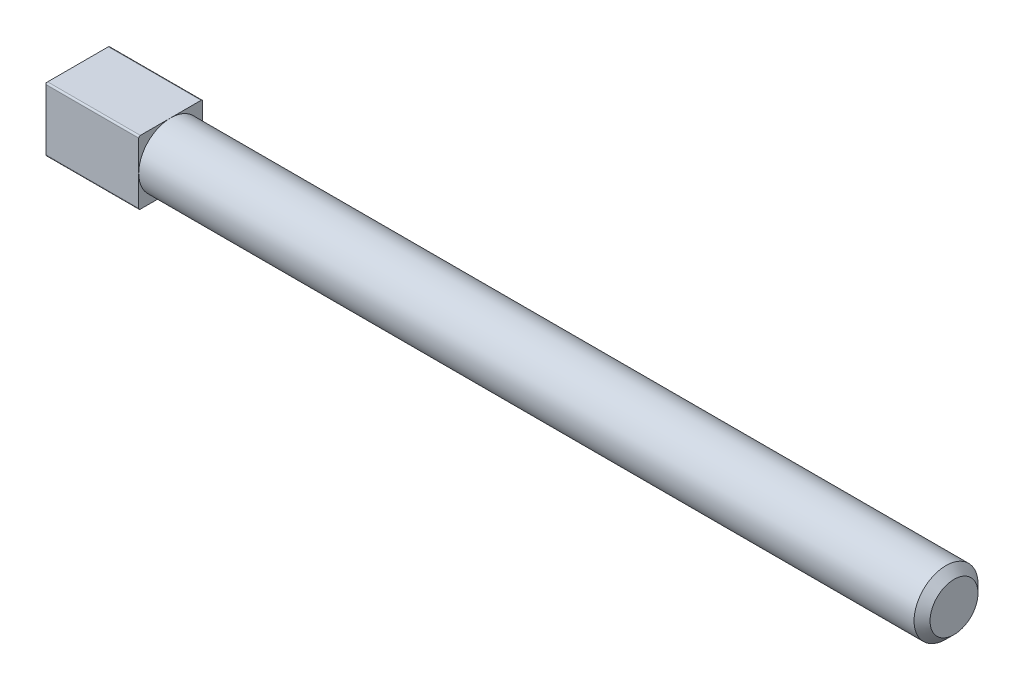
from build123d import *

# Parameters (mm, degrees)
SKETCH_1_W      = 4
SKETCH_1_H      = 4
EXTRUDE_1_DEPTH = 6
SKETCH_2_R      = 2
EXTRUDE_2_DEPTH = 49
CHAMFER_1_SIZE  = 0.5
CHAMFER_2_SIZE  = 0.2
FILLET_1_R      = 0.1


with BuildPart() as part:
    # Sketch 1 → Extrude 1 (new body)
    with BuildSketch(Plane(origin=(0, 0, 0), x_dir=(0, 0, -1), z_dir=(1, 0, 0))):
        Rectangle(SKETCH_1_W, SKETCH_1_H)
    extrude(amount=EXTRUDE_1_DEPTH)

    # Sketch 2 → Extrude 2 (add)
    with BuildSketch(Plane(origin=(6, 0, 0), x_dir=(0, 0, -1), z_dir=(1, 0, 0))):
        Circle(SKETCH_2_R)
    extrude(amount=EXTRUDE_2_DEPTH)

    # Chamfer 1
    chamfer_1_edges = [part.edges().sort_by_distance(p)[0] for p in [
        (55, 0, 2),
    ]]
    chamfer(chamfer_1_edges, length=CHAMFER_1_SIZE)

    # Chamfer 2
    chamfer_2_edges = [part.edges().sort_by_distance(p)[0] for p in [
        (0, 0, 2),
        (0, 2, 0),
        (0, 0, -2),
        (0, -2, 0),
    ]]
    chamfer(chamfer_2_edges, length=CHAMFER_2_SIZE)

    # Fillet 1
    fillet_1_edges = [part.edges().sort_by_distance(p)[0] for p in [
        (3.1, -2, 2),
        (3.1, 2, 2),
        (3.1, 2, -2),
        (3.1, -2, -2),
    ]]
    fillet(fillet_1_edges, radius=FILLET_1_R)


solid = part.part
